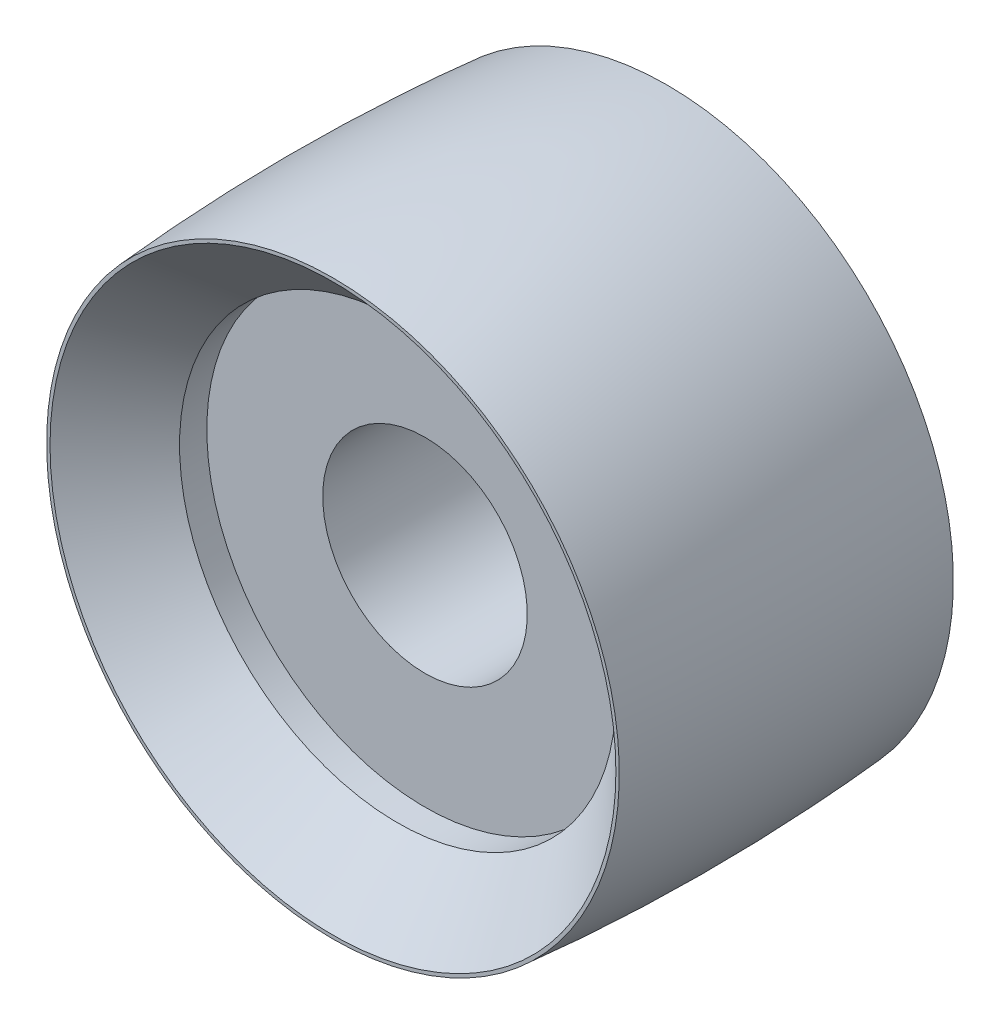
ISO-10303-21;
HEADER;
FILE_DESCRIPTION(('STEP AP214'),'2;1');
FILE_NAME('part.step','',(''),(''),'','','');
FILE_SCHEMA(('AUTOMOTIVE_DESIGN { 1 0 10303 214 1 1 1 1 }'));
ENDSEC;
DATA;
#1=APPLICATION_CONTEXT('core data for automotive mechanical design processes');
#2=APPLICATION_PROTOCOL_DEFINITION('international standard','automotive_design',2000,#1);
#3=PRODUCT_CONTEXT('',#1,'mechanical');
#4=PRODUCT('Part','Part','',(#3));
#5=PRODUCT_RELATED_PRODUCT_CATEGORY('part','',(#4));
#6=PRODUCT_DEFINITION_FORMATION('','',#4);
#7=PRODUCT_DEFINITION_CONTEXT('part definition',#1,'design');
#8=PRODUCT_DEFINITION('design','',#6,#7);
#9=PRODUCT_DEFINITION_SHAPE('','',#8);
#10=(LENGTH_UNIT() NAMED_UNIT(*) SI_UNIT(.MILLI.,.METRE.));
#11=(NAMED_UNIT(*) PLANE_ANGLE_UNIT() SI_UNIT($,.RADIAN.));
#12=(NAMED_UNIT(*) SI_UNIT($,.STERADIAN.) SOLID_ANGLE_UNIT());
#13=UNCERTAINTY_MEASURE_WITH_UNIT(LENGTH_MEASURE(1.E-05),#10,'distance_accuracy_value','');
#14=(GEOMETRIC_REPRESENTATION_CONTEXT(3) GLOBAL_UNCERTAINTY_ASSIGNED_CONTEXT((#13)) GLOBAL_UNIT_ASSIGNED_CONTEXT((#10,
#11,#12)) REPRESENTATION_CONTEXT('',''));
#15=CARTESIAN_POINT('',(0.,0.,0.));
#16=DIRECTION('',(0.,0.,1.));
#17=DIRECTION('',(1.,0.,0.));
#18=AXIS2_PLACEMENT_3D('',#15,#16,#17);
#19=CARTESIAN_POINT('',(0.,0.,5.5));
#20=DIRECTION('',(0.,0.,1.));
#21=DIRECTION('',(1.,0.,0.));
#22=AXIS2_PLACEMENT_3D('',#19,#20,#21);
#23=CYLINDRICAL_SURFACE('',#22,16.);
#24=CARTESIAN_POINT('',(0.,0.,5.5));
#25=DIRECTION('',(0.,0.,1.));
#26=DIRECTION('',(1.,0.,0.));
#27=AXIS2_PLACEMENT_3D('',#24,#25,#26);
#28=CIRCLE('',#27,16.);
#29=CARTESIAN_POINT('',(16.,0.,5.5));
#30=VERTEX_POINT('',#29);
#31=EDGE_CURVE('E16',#30,#30,#28,.F.);
#32=ORIENTED_EDGE('',*,*,#31,.T.);
#33=EDGE_LOOP('',(#32));
#34=FACE_BOUND('',#33,.T.);
#35=CARTESIAN_POINT('',(0.,0.,7.5));
#36=DIRECTION('',(0.,0.,1.));
#37=DIRECTION('',(1.,0.,0.));
#38=AXIS2_PLACEMENT_3D('',#35,#36,#37);
#39=CIRCLE('',#38,16.);
#40=CARTESIAN_POINT('',(16.,0.,7.49999999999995));
#41=VERTEX_POINT('',#40);
#42=EDGE_CURVE('E28',#41,#41,#39,.T.);
#43=ORIENTED_EDGE('',*,*,#42,.T.);
#44=EDGE_LOOP('',(#43));
#45=FACE_BOUND('',#44,.T.);
#46=ADVANCED_FACE('F12',(#34,#45),#23,.F.);
#47=CARTESIAN_POINT('',(0.,0.,7.5));
#48=DIRECTION('',(0.,0.,1.));
#49=DIRECTION('',(1.,0.,0.));
#50=AXIS2_PLACEMENT_3D('',#47,#48,#49);
#51=CONICAL_SURFACE('',#50,16.,0.785398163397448);
#52=ORIENTED_EDGE('',*,*,#42,.F.);
#53=EDGE_LOOP('',(#52));
#54=FACE_BOUND('',#53,.T.);
#55=CARTESIAN_POINT('',(0.,0.,12.25));
#56=DIRECTION('',(0.,0.,1.));
#57=DIRECTION('',(1.,0.,0.));
#58=AXIS2_PLACEMENT_3D('',#55,#56,#57);
#59=CIRCLE('',#58,20.75);
#60=CARTESIAN_POINT('',(20.75,0.,12.25));
#61=VERTEX_POINT('',#60);
#62=EDGE_CURVE('E44',#61,#61,#59,.T.);
#63=ORIENTED_EDGE('',*,*,#62,.T.);
#64=EDGE_LOOP('',(#63));
#65=FACE_BOUND('',#64,.T.);
#66=ADVANCED_FACE('F56',(#54,#65),#51,.F.);
#67=CARTESIAN_POINT('',(16.192,-16.247716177,5.5));
#68=DIRECTION('',(0.,0.,-1.));
#69=DIRECTION('',(-1.,0.,0.));
#70=AXIS2_PLACEMENT_3D('',#67,#68,#69);
#71=PLANE('',#70);
#72=CARTESIAN_POINT('',(0.,0.,5.5));
#73=DIRECTION('',(0.,0.,1.));
#74=DIRECTION('',(0.,-1.,0.));
#75=AXIS2_PLACEMENT_3D('',#72,#73,#74);
#76=CIRCLE('',#75,7.5);
#77=CARTESIAN_POINT('',(0.,-7.5,5.5));
#78=VERTEX_POINT('',#77);
#79=EDGE_CURVE('E42',#78,#78,#76,.F.);
#80=ORIENTED_EDGE('',*,*,#79,.T.);
#81=EDGE_LOOP('',(#80));
#82=FACE_BOUND('',#81,.T.);
#83=ORIENTED_EDGE('',*,*,#31,.F.);
#84=EDGE_LOOP('',(#83));
#85=FACE_BOUND('',#84,.T.);
#86=ADVANCED_FACE('F53',(#82,#85),#71,.F.);
#87=CARTESIAN_POINT('',(21.250942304,-21.324066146,12.25));
#88=DIRECTION('',(0.,0.,-1.));
#89=DIRECTION('',(-1.,0.,0.));
#90=AXIS2_PLACEMENT_3D('',#87,#88,#89);
#91=PLANE('',#90);
#92=ORIENTED_EDGE('',*,*,#62,.F.);
#93=EDGE_LOOP('',(#92));
#94=FACE_BOUND('',#93,.T.);
#95=CARTESIAN_POINT('',(0.,0.,12.25));
#96=DIRECTION('',(0.,0.,1.));
#97=DIRECTION('',(0.,-1.,0.));
#98=AXIS2_PLACEMENT_3D('',#95,#96,#97);
#99=CIRCLE('',#98,20.998954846);
#100=CARTESIAN_POINT('',(0.,-20.998954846,12.25));
#101=VERTEX_POINT('',#100);
#102=EDGE_CURVE('E39',#101,#101,#99,.F.);
#103=ORIENTED_EDGE('',*,*,#102,.F.);
#104=EDGE_LOOP('',(#103));
#105=FACE_BOUND('',#104,.T.);
#106=ADVANCED_FACE('F55',(#94,#105),#91,.F.);
#107=CARTESIAN_POINT('',(0.,0.,-5.5));
#108=DIRECTION('',(0.,0.,1.));
#109=DIRECTION('',(0.,-1.,0.));
#110=AXIS2_PLACEMENT_3D('',#107,#108,#109);
#111=CYLINDRICAL_SURFACE('',#110,7.5);
#112=CARTESIAN_POINT('',(0.,0.,-5.5));
#113=DIRECTION('',(0.,0.,1.));
#114=DIRECTION('',(0.,-1.,0.));
#115=AXIS2_PLACEMENT_3D('',#112,#113,#114);
#116=CIRCLE('',#115,7.5);
#117=CARTESIAN_POINT('',(0.,-7.5,-5.5));
#118=VERTEX_POINT('',#117);
#119=EDGE_CURVE('E36',#118,#118,#116,.F.);
#120=ORIENTED_EDGE('',*,*,#119,.T.);
#121=EDGE_LOOP('',(#120));
#122=FACE_BOUND('',#121,.T.);
#123=ORIENTED_EDGE('',*,*,#79,.F.);
#124=EDGE_LOOP('',(#123));
#125=FACE_BOUND('',#124,.T.);
#126=ADVANCED_FACE('F65',(#122,#125),#111,.F.);
#127=CARTESIAN_POINT('',(0.,0.,0.));
#128=DIRECTION('',(0.,0.,1.));
#129=DIRECTION('',(0.,-1.,0.));
#130=AXIS2_PLACEMENT_3D('',#127,#128,#129);
#131=DEGENERATE_TOROIDAL_SURFACE('',#130,128.499999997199,149.999999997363,.F.);
#132=ORIENTED_EDGE('',*,*,#102,.T.);
#133=EDGE_LOOP('',(#132));
#134=FACE_BOUND('',#133,.T.);
#135=CARTESIAN_POINT('',(0.,0.,-12.25000000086));
#136=DIRECTION('',(0.,0.,1.));
#137=DIRECTION('',(0.,-1.,0.));
#138=AXIS2_PLACEMENT_3D('',#135,#136,#137);
#139=CIRCLE('',#138,20.9989548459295);
#140=CARTESIAN_POINT('',(0.,-20.9989548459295,-12.25000000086));
#141=VERTEX_POINT('',#140);
#142=EDGE_CURVE('E33',#141,#141,#139,.T.);
#143=ORIENTED_EDGE('',*,*,#142,.T.);
#144=EDGE_LOOP('',(#143));
#145=FACE_BOUND('',#144,.T.);
#146=ADVANCED_FACE('F85',(#134,#145),#131,.F.);
#147=CARTESIAN_POINT('',(-16.192,-16.247716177,-5.5));
#148=DIRECTION('',(0.,0.,1.));
#149=DIRECTION('',(1.,0.,0.));
#150=AXIS2_PLACEMENT_3D('',#147,#148,#149);
#151=PLANE('',#150);
#152=ORIENTED_EDGE('',*,*,#119,.F.);
#153=EDGE_LOOP('',(#152));
#154=FACE_BOUND('',#153,.T.);
#155=CARTESIAN_POINT('',(0.,0.,-5.5));
#156=DIRECTION('',(0.,0.,1.));
#157=DIRECTION('',(1.,0.,0.));
#158=AXIS2_PLACEMENT_3D('',#155,#156,#157);
#159=CIRCLE('',#158,16.);
#160=CARTESIAN_POINT('',(16.,0.,-5.5));
#161=VERTEX_POINT('',#160);
#162=EDGE_CURVE('E25',#161,#161,#159,.F.);
#163=ORIENTED_EDGE('',*,*,#162,.T.);
#164=EDGE_LOOP('',(#163));
#165=FACE_BOUND('',#164,.T.);
#166=ADVANCED_FACE('F135',(#154,#165),#151,.F.);
#167=CARTESIAN_POINT('',(-21.250942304,-21.324066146,-12.25));
#168=DIRECTION('',(0.,0.,1.));
#169=DIRECTION('',(1.,0.,0.));
#170=AXIS2_PLACEMENT_3D('',#167,#168,#169);
#171=PLANE('',#170);
#172=CARTESIAN_POINT('',(0.,0.,-12.25));
#173=DIRECTION('',(0.,0.,-1.));
#174=DIRECTION('',(-1.,0.,0.));
#175=AXIS2_PLACEMENT_3D('',#172,#173,#174);
#176=CIRCLE('',#175,20.75);
#177=CARTESIAN_POINT('',(-20.75,0.,-12.25));
#178=VERTEX_POINT('',#177);
#179=EDGE_CURVE('E20',#178,#178,#176,.F.);
#180=ORIENTED_EDGE('',*,*,#179,.T.);
#181=EDGE_LOOP('',(#180));
#182=FACE_BOUND('',#181,.T.);
#183=ORIENTED_EDGE('',*,*,#142,.F.);
#184=EDGE_LOOP('',(#183));
#185=FACE_BOUND('',#184,.T.);
#186=ADVANCED_FACE('F14',(#182,#185),#171,.F.);
#187=CARTESIAN_POINT('',(0.,0.,-7.5));
#188=DIRECTION('',(0.,0.,1.));
#189=DIRECTION('',(1.,0.,0.));
#190=AXIS2_PLACEMENT_3D('',#187,#188,#189);
#191=CYLINDRICAL_SURFACE('',#190,16.);
#192=ORIENTED_EDGE('',*,*,#162,.F.);
#193=EDGE_LOOP('',(#192));
#194=FACE_BOUND('',#193,.T.);
#195=CARTESIAN_POINT('',(0.,0.,-7.5));
#196=DIRECTION('',(0.,0.,-1.));
#197=DIRECTION('',(-1.,0.,0.));
#198=AXIS2_PLACEMENT_3D('',#195,#196,#197);
#199=CIRCLE('',#198,16.);
#200=CARTESIAN_POINT('',(-16.,0.,-7.50000000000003));
#201=VERTEX_POINT('',#200);
#202=EDGE_CURVE('E8',#201,#201,#199,.T.);
#203=ORIENTED_EDGE('',*,*,#202,.T.);
#204=EDGE_LOOP('',(#203));
#205=FACE_BOUND('',#204,.T.);
#206=ADVANCED_FACE('F73',(#194,#205),#191,.F.);
#207=CARTESIAN_POINT('',(0.,0.,-7.5));
#208=DIRECTION('',(0.,0.,-1.));
#209=DIRECTION('',(-1.,0.,0.));
#210=AXIS2_PLACEMENT_3D('',#207,#208,#209);
#211=CONICAL_SURFACE('',#210,16.,0.785398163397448);
#212=ORIENTED_EDGE('',*,*,#179,.F.);
#213=EDGE_LOOP('',(#212));
#214=FACE_BOUND('',#213,.T.);
#215=ORIENTED_EDGE('',*,*,#202,.F.);
#216=EDGE_LOOP('',(#215));
#217=FACE_BOUND('',#216,.T.);
#218=ADVANCED_FACE('F71',(#214,#217),#211,.F.);
#219=CLOSED_SHELL('',(#46,#66,#86,#106,#126,#146,#166,#186,#206,#218));
#220=MANIFOLD_SOLID_BREP('B1',#219);
#221=ADVANCED_BREP_SHAPE_REPRESENTATION('',(#18,#220),#14);
#222=SHAPE_DEFINITION_REPRESENTATION(#9,#221);
ENDSEC;
END-ISO-10303-21;
